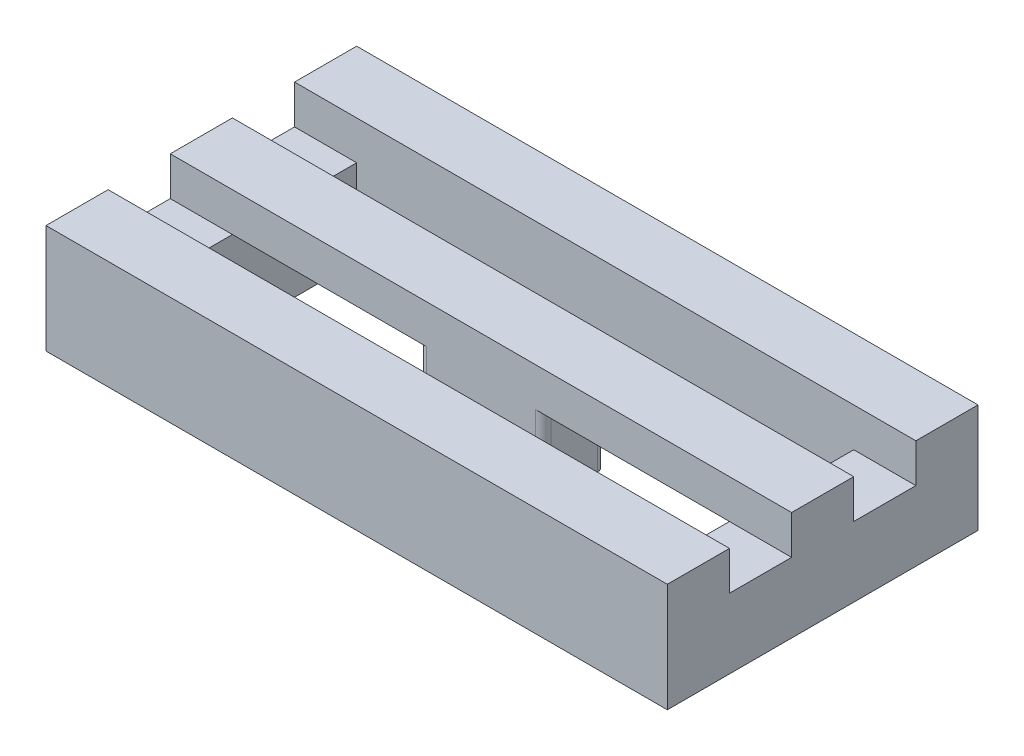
ISO-10303-21;
HEADER;
FILE_DESCRIPTION(('STEP AP214'),'2;1');
FILE_NAME('part.step','',(''),(''),'','','');
FILE_SCHEMA(('AUTOMOTIVE_DESIGN { 1 0 10303 214 1 1 1 1 }'));
ENDSEC;
DATA;
#1=APPLICATION_CONTEXT('core data for automotive mechanical design processes');
#2=APPLICATION_PROTOCOL_DEFINITION('international standard','automotive_design',2000,#1);
#3=PRODUCT_CONTEXT('',#1,'mechanical');
#4=PRODUCT('Part','Part','',(#3));
#5=PRODUCT_RELATED_PRODUCT_CATEGORY('part','',(#4));
#6=PRODUCT_DEFINITION_FORMATION('','',#4);
#7=PRODUCT_DEFINITION_CONTEXT('part definition',#1,'design');
#8=PRODUCT_DEFINITION('design','',#6,#7);
#9=PRODUCT_DEFINITION_SHAPE('','',#8);
#10=(LENGTH_UNIT() NAMED_UNIT(*) SI_UNIT(.MILLI.,.METRE.));
#11=(NAMED_UNIT(*) PLANE_ANGLE_UNIT() SI_UNIT($,.RADIAN.));
#12=(NAMED_UNIT(*) SI_UNIT($,.STERADIAN.) SOLID_ANGLE_UNIT());
#13=UNCERTAINTY_MEASURE_WITH_UNIT(LENGTH_MEASURE(1.E-05),#10,'distance_accuracy_value','');
#14=(GEOMETRIC_REPRESENTATION_CONTEXT(3) GLOBAL_UNCERTAINTY_ASSIGNED_CONTEXT((#13)) GLOBAL_UNIT_ASSIGNED_CONTEXT((#10,
#11,#12)) REPRESENTATION_CONTEXT('',''));
#15=CARTESIAN_POINT('',(0.,0.,0.));
#16=DIRECTION('',(0.,0.,1.));
#17=DIRECTION('',(1.,0.,0.));
#18=AXIS2_PLACEMENT_3D('',#15,#16,#17);
#19=CARTESIAN_POINT('',(0.,3.2,0.));
#20=DIRECTION('',(1.,0.,0.));
#21=DIRECTION('',(0.,0.,-1.));
#22=AXIS2_PLACEMENT_3D('',#19,#20,#21);
#23=PLANE('',#22);
#24=DIRECTION('',(0.,0.,1.));
#25=VECTOR('',#24,1.);
#26=CARTESIAN_POINT('',(0.,0.4,-18.0554430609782));
#27=LINE('',#26,#25);
#28=CARTESIAN_POINT('',(0.,0.4,-8.));
#29=VERTEX_POINT('',#28);
#30=CARTESIAN_POINT('',(0.,0.4,0.));
#31=VERTEX_POINT('',#30);
#32=EDGE_CURVE('E40',#29,#31,#27,.T.);
#33=ORIENTED_EDGE('',*,*,#32,.T.);
#34=DIRECTION('',(0.,-1.,0.));
#35=VECTOR('',#34,1.);
#36=CARTESIAN_POINT('',(0.,3.2,0.));
#37=LINE('',#36,#35);
#38=CARTESIAN_POINT('',(0.,3.2,0.));
#39=VERTEX_POINT('',#38);
#40=EDGE_CURVE('E403',#39,#31,#37,.T.);
#41=ORIENTED_EDGE('',*,*,#40,.F.);
#42=DIRECTION('',(0.,0.,1.));
#43=VECTOR('',#42,1.);
#44=CARTESIAN_POINT('',(0.,3.2,0.));
#45=LINE('',#44,#43);
#46=CARTESIAN_POINT('',(0.,3.2,-1.6));
#47=VERTEX_POINT('',#46);
#48=EDGE_CURVE('E373',#47,#39,#45,.T.);
#49=ORIENTED_EDGE('',*,*,#48,.F.);
#50=DIRECTION('',(0.,1.,0.));
#51=VECTOR('',#50,1.);
#52=CARTESIAN_POINT('',(0.,2.2,-1.6));
#53=LINE('',#52,#51);
#54=CARTESIAN_POINT('',(0.,2.2,-1.6));
#55=VERTEX_POINT('',#54);
#56=EDGE_CURVE('E346',#55,#47,#53,.T.);
#57=ORIENTED_EDGE('',*,*,#56,.F.);
#58=DIRECTION('',(0.,0.,1.));
#59=VECTOR('',#58,1.);
#60=CARTESIAN_POINT('',(0.,2.2,-4.));
#61=LINE('',#60,#59);
#62=CARTESIAN_POINT('',(0.,2.2,-3.2));
#63=VERTEX_POINT('',#62);
#64=EDGE_CURVE('E332',#63,#55,#61,.T.);
#65=ORIENTED_EDGE('',*,*,#64,.F.);
#66=DIRECTION('',(0.,1.,0.));
#67=VECTOR('',#66,1.);
#68=CARTESIAN_POINT('',(0.,2.2,-3.2));
#69=LINE('',#68,#67);
#70=CARTESIAN_POINT('',(0.,3.2,-3.2));
#71=VERTEX_POINT('',#70);
#72=EDGE_CURVE('E348',#63,#71,#69,.T.);
#73=ORIENTED_EDGE('',*,*,#72,.T.);
#74=CARTESIAN_POINT('',(0.,3.2,-4.8));
#75=VERTEX_POINT('',#74);
#76=EDGE_CURVE('E385',#75,#71,#45,.T.);
#77=ORIENTED_EDGE('',*,*,#76,.F.);
#78=DIRECTION('',(0.,1.,0.));
#79=VECTOR('',#78,1.);
#80=CARTESIAN_POINT('',(0.,2.2,-4.8));
#81=LINE('',#80,#79);
#82=CARTESIAN_POINT('',(0.,2.2,-4.8));
#83=VERTEX_POINT('',#82);
#84=EDGE_CURVE('E371',#83,#75,#81,.T.);
#85=ORIENTED_EDGE('',*,*,#84,.F.);
#86=DIRECTION('',(0.,0.,1.));
#87=VECTOR('',#86,1.);
#88=CARTESIAN_POINT('',(0.,2.2,-4.));
#89=LINE('',#88,#87);
#90=CARTESIAN_POINT('',(0.,2.2,-6.4));
#91=VERTEX_POINT('',#90);
#92=EDGE_CURVE('E367',#91,#83,#89,.T.);
#93=ORIENTED_EDGE('',*,*,#92,.F.);
#94=DIRECTION('',(0.,1.,0.));
#95=VECTOR('',#94,1.);
#96=CARTESIAN_POINT('',(0.,2.2,-6.4));
#97=LINE('',#96,#95);
#98=CARTESIAN_POINT('',(0.,3.2,-6.4));
#99=VERTEX_POINT('',#98);
#100=EDGE_CURVE('E374',#91,#99,#97,.T.);
#101=ORIENTED_EDGE('',*,*,#100,.T.);
#102=CARTESIAN_POINT('',(0.,3.2,-8.));
#103=VERTEX_POINT('',#102);
#104=EDGE_CURVE('E381',#103,#99,#45,.T.);
#105=ORIENTED_EDGE('',*,*,#104,.F.);
#106=DIRECTION('',(0.,-1.,0.));
#107=VECTOR('',#106,1.);
#108=CARTESIAN_POINT('',(0.,3.2,-8.));
#109=LINE('',#108,#107);
#110=EDGE_CURVE('E394',#103,#29,#109,.T.);
#111=ORIENTED_EDGE('',*,*,#110,.T.);
#112=EDGE_LOOP('',(#33,#41,#49,#57,#65,#73,#77,#85,#93,#101,#105,#111));
#113=FACE_BOUND('',#112,.T.);
#114=ADVANCED_FACE('F26',(#113),#23,.F.);
#115=CARTESIAN_POINT('',(16.,3.2,0.));
#116=DIRECTION('',(-1.,0.,0.));
#117=DIRECTION('',(0.,0.,1.));
#118=AXIS2_PLACEMENT_3D('',#115,#116,#117);
#119=PLANE('',#118);
#120=DIRECTION('',(0.,0.,-1.));
#121=VECTOR('',#120,1.);
#122=CARTESIAN_POINT('',(16.,0.4,-18.0554430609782));
#123=LINE('',#122,#121);
#124=CARTESIAN_POINT('',(16.,0.4,0.));
#125=VERTEX_POINT('',#124);
#126=CARTESIAN_POINT('',(16.,0.4,-8.));
#127=VERTEX_POINT('',#126);
#128=EDGE_CURVE('E251',#125,#127,#123,.T.);
#129=ORIENTED_EDGE('',*,*,#128,.T.);
#130=DIRECTION('',(0.,-1.,0.));
#131=VECTOR('',#130,1.);
#132=CARTESIAN_POINT('',(16.,3.2,-8.));
#133=LINE('',#132,#131);
#134=CARTESIAN_POINT('',(16.,3.2,-8.));
#135=VERTEX_POINT('',#134);
#136=EDGE_CURVE('E397',#135,#127,#133,.T.);
#137=ORIENTED_EDGE('',*,*,#136,.F.);
#138=DIRECTION('',(0.,0.,-1.));
#139=VECTOR('',#138,1.);
#140=CARTESIAN_POINT('',(16.,3.2,0.));
#141=LINE('',#140,#139);
#142=CARTESIAN_POINT('',(16.,3.2,-6.4));
#143=VERTEX_POINT('',#142);
#144=EDGE_CURVE('E387',#143,#135,#141,.T.);
#145=ORIENTED_EDGE('',*,*,#144,.F.);
#146=DIRECTION('',(0.,1.,0.));
#147=VECTOR('',#146,1.);
#148=CARTESIAN_POINT('',(16.,2.2,-6.4));
#149=LINE('',#148,#147);
#150=CARTESIAN_POINT('',(16.,2.2,-6.4));
#151=VERTEX_POINT('',#150);
#152=EDGE_CURVE('E377',#151,#143,#149,.T.);
#153=ORIENTED_EDGE('',*,*,#152,.F.);
#154=DIRECTION('',(0.,0.,-1.));
#155=VECTOR('',#154,1.);
#156=CARTESIAN_POINT('',(16.,2.2,-4.));
#157=LINE('',#156,#155);
#158=CARTESIAN_POINT('',(16.,2.2,-4.8));
#159=VERTEX_POINT('',#158);
#160=EDGE_CURVE('E360',#159,#151,#157,.T.);
#161=ORIENTED_EDGE('',*,*,#160,.F.);
#162=DIRECTION('',(0.,1.,0.));
#163=VECTOR('',#162,1.);
#164=CARTESIAN_POINT('',(16.,2.2,-4.8));
#165=LINE('',#164,#163);
#166=CARTESIAN_POINT('',(16.,3.2,-4.8));
#167=VERTEX_POINT('',#166);
#168=EDGE_CURVE('E370',#159,#167,#165,.T.);
#169=ORIENTED_EDGE('',*,*,#168,.T.);
#170=CARTESIAN_POINT('',(16.,3.2,-3.2));
#171=VERTEX_POINT('',#170);
#172=EDGE_CURVE('E392',#171,#167,#141,.T.);
#173=ORIENTED_EDGE('',*,*,#172,.F.);
#174=DIRECTION('',(0.,1.,0.));
#175=VECTOR('',#174,1.);
#176=CARTESIAN_POINT('',(16.,2.2,-3.2));
#177=LINE('',#176,#175);
#178=CARTESIAN_POINT('',(16.,2.2,-3.2));
#179=VERTEX_POINT('',#178);
#180=EDGE_CURVE('E341',#179,#171,#177,.T.);
#181=ORIENTED_EDGE('',*,*,#180,.F.);
#182=DIRECTION('',(0.,0.,-1.));
#183=VECTOR('',#182,1.);
#184=CARTESIAN_POINT('',(16.,2.2,-4.));
#185=LINE('',#184,#183);
#186=CARTESIAN_POINT('',(16.,2.2,-1.6));
#187=VERTEX_POINT('',#186);
#188=EDGE_CURVE('E325',#187,#179,#185,.T.);
#189=ORIENTED_EDGE('',*,*,#188,.F.);
#190=DIRECTION('',(0.,1.,0.));
#191=VECTOR('',#190,1.);
#192=CARTESIAN_POINT('',(16.,2.2,-1.6));
#193=LINE('',#192,#191);
#194=CARTESIAN_POINT('',(16.,3.2,-1.6));
#195=VERTEX_POINT('',#194);
#196=EDGE_CURVE('E342',#187,#195,#193,.T.);
#197=ORIENTED_EDGE('',*,*,#196,.T.);
#198=CARTESIAN_POINT('',(16.,3.2,0.));
#199=VERTEX_POINT('',#198);
#200=EDGE_CURVE('E388',#199,#195,#141,.T.);
#201=ORIENTED_EDGE('',*,*,#200,.F.);
#202=DIRECTION('',(0.,-1.,0.));
#203=VECTOR('',#202,1.);
#204=CARTESIAN_POINT('',(16.,3.2,0.));
#205=LINE('',#204,#203);
#206=EDGE_CURVE('E400',#199,#125,#205,.T.);
#207=ORIENTED_EDGE('',*,*,#206,.T.);
#208=EDGE_LOOP('',(#129,#137,#145,#153,#161,#169,#173,#181,#189,#197,#201,#207));
#209=FACE_BOUND('',#208,.T.);
#210=ADVANCED_FACE('F498',(#209),#119,.F.);
#211=CARTESIAN_POINT('',(0.,3.2,0.));
#212=DIRECTION('',(0.,0.,-1.));
#213=DIRECTION('',(-1.,0.,0.));
#214=AXIS2_PLACEMENT_3D('',#211,#212,#213);
#215=PLANE('',#214);
#216=DIRECTION('',(1.,0.,0.));
#217=VECTOR('',#216,1.);
#218=CARTESIAN_POINT('',(8.,0.4,0.));
#219=LINE('',#218,#217);
#220=EDGE_CURVE('E254',#31,#125,#219,.T.);
#221=ORIENTED_EDGE('',*,*,#220,.T.);
#222=ORIENTED_EDGE('',*,*,#206,.F.);
#223=DIRECTION('',(1.,0.,0.));
#224=VECTOR('',#223,1.);
#225=CARTESIAN_POINT('',(0.,3.2,0.));
#226=LINE('',#225,#224);
#227=EDGE_CURVE('E384',#39,#199,#226,.T.);
#228=ORIENTED_EDGE('',*,*,#227,.F.);
#229=ORIENTED_EDGE('',*,*,#40,.T.);
#230=EDGE_LOOP('',(#221,#222,#228,#229));
#231=FACE_BOUND('',#230,.T.);
#232=ADVANCED_FACE('F530',(#231),#215,.F.);
#233=CARTESIAN_POINT('',(0.,3.2,-8.));
#234=DIRECTION('',(0.,0.,1.));
#235=DIRECTION('',(1.,0.,0.));
#236=AXIS2_PLACEMENT_3D('',#233,#234,#235);
#237=PLANE('',#236);
#238=DIRECTION('',(-1.,0.,0.));
#239=VECTOR('',#238,1.);
#240=CARTESIAN_POINT('',(8.,0.4,-8.));
#241=LINE('',#240,#239);
#242=EDGE_CURVE('E249',#127,#29,#241,.T.);
#243=ORIENTED_EDGE('',*,*,#242,.T.);
#244=ORIENTED_EDGE('',*,*,#110,.F.);
#245=DIRECTION('',(-1.,0.,0.));
#246=VECTOR('',#245,1.);
#247=CARTESIAN_POINT('',(0.,3.2,-8.));
#248=LINE('',#247,#246);
#249=EDGE_CURVE('E391',#135,#103,#248,.T.);
#250=ORIENTED_EDGE('',*,*,#249,.F.);
#251=ORIENTED_EDGE('',*,*,#136,.T.);
#252=EDGE_LOOP('',(#243,#244,#250,#251));
#253=FACE_BOUND('',#252,.T.);
#254=ADVANCED_FACE('F500',(#253),#237,.F.);
#255=CARTESIAN_POINT('',(1.6,2.2,-6.4));
#256=DIRECTION('',(0.,-1.,0.));
#257=DIRECTION('',(0.,0.,-1.));
#258=AXIS2_PLACEMENT_3D('',#255,#256,#257);
#259=PLANE('',#258);
#260=DIRECTION('',(-1.,0.,0.));
#261=VECTOR('',#260,1.);
#262=CARTESIAN_POINT('',(-6.05544306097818,2.2,-4.8));
#263=LINE('',#262,#261);
#264=CARTESIAN_POINT('',(6.6,2.2,-4.8));
#265=VERTEX_POINT('',#264);
#266=CARTESIAN_POINT('',(1.6,2.2,-4.8));
#267=VERTEX_POINT('',#266);
#268=EDGE_CURVE('E311',#265,#267,#263,.T.);
#269=ORIENTED_EDGE('',*,*,#268,.F.);
#270=CARTESIAN_POINT('',(6.6,2.2,-4.6));
#271=DIRECTION('',(0.,-1.,0.));
#272=DIRECTION('',(0.,0.,-1.));
#273=AXIS2_PLACEMENT_3D('',#270,#271,#272);
#274=CIRCLE('',#273,0.2);
#275=CARTESIAN_POINT('',(6.4,2.2,-4.6));
#276=VERTEX_POINT('',#275);
#277=EDGE_CURVE('E436',#265,#276,#274,.F.);
#278=ORIENTED_EDGE('',*,*,#277,.T.);
#279=DIRECTION('',(0.,0.,-1.));
#280=VECTOR('',#279,1.);
#281=CARTESIAN_POINT('',(6.4,2.2,-3.2));
#282=LINE('',#281,#280);
#283=CARTESIAN_POINT('',(6.4,2.2,-3.4));
#284=VERTEX_POINT('',#283);
#285=EDGE_CURVE('E268',#284,#276,#282,.T.);
#286=ORIENTED_EDGE('',*,*,#285,.F.);
#287=CARTESIAN_POINT('',(6.6,2.2,-3.4));
#288=DIRECTION('',(0.,-1.,0.));
#289=DIRECTION('',(0.,0.,-1.));
#290=AXIS2_PLACEMENT_3D('',#287,#288,#289);
#291=CIRCLE('',#290,0.2);
#292=CARTESIAN_POINT('',(6.6,2.2,-3.2));
#293=VERTEX_POINT('',#292);
#294=EDGE_CURVE('E438',#284,#293,#291,.F.);
#295=ORIENTED_EDGE('',*,*,#294,.T.);
#296=DIRECTION('',(-1.,0.,0.));
#297=VECTOR('',#296,1.);
#298=CARTESIAN_POINT('',(-6.05544306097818,2.2,-3.2));
#299=LINE('',#298,#297);
#300=CARTESIAN_POINT('',(1.6,2.2,-3.2));
#301=VERTEX_POINT('',#300);
#302=EDGE_CURVE('E334',#293,#301,#299,.T.);
#303=ORIENTED_EDGE('',*,*,#302,.T.);
#304=DIRECTION('',(0.,0.,-1.));
#305=VECTOR('',#304,1.);
#306=CARTESIAN_POINT('',(1.6,2.2,-1.6));
#307=LINE('',#306,#305);
#308=EDGE_CURVE('E304',#301,#267,#307,.T.);
#309=ORIENTED_EDGE('',*,*,#308,.T.);
#310=EDGE_LOOP('',(#269,#278,#286,#295,#303,#309));
#311=FACE_BOUND('',#310,.T.);
#312=ADVANCED_FACE('F475',(#311),#259,.T.);
#313=CARTESIAN_POINT('',(14.4,2.2,-3.2));
#314=VERTEX_POINT('',#313);
#315=CARTESIAN_POINT('',(9.4,2.2,-3.2));
#316=VERTEX_POINT('',#315);
#317=EDGE_CURVE('E333',#314,#316,#299,.T.);
#318=ORIENTED_EDGE('',*,*,#317,.T.);
#319=CARTESIAN_POINT('',(9.4,2.2,-3.4));
#320=DIRECTION('',(0.,-1.,0.));
#321=DIRECTION('',(0.,0.,-1.));
#322=AXIS2_PLACEMENT_3D('',#319,#320,#321);
#323=CIRCLE('',#322,0.2);
#324=CARTESIAN_POINT('',(9.6,2.2,-3.4));
#325=VERTEX_POINT('',#324);
#326=EDGE_CURVE('E11',#316,#325,#323,.F.);
#327=ORIENTED_EDGE('',*,*,#326,.T.);
#328=DIRECTION('',(0.,0.,1.));
#329=VECTOR('',#328,1.);
#330=CARTESIAN_POINT('',(9.6,2.2,-3.2));
#331=LINE('',#330,#329);
#332=CARTESIAN_POINT('',(9.6,2.2,-4.6));
#333=VERTEX_POINT('',#332);
#334=EDGE_CURVE('E273',#333,#325,#331,.T.);
#335=ORIENTED_EDGE('',*,*,#334,.F.);
#336=CARTESIAN_POINT('',(9.4,2.2,-4.6));
#337=DIRECTION('',(0.,-1.,0.));
#338=DIRECTION('',(0.,0.,-1.));
#339=AXIS2_PLACEMENT_3D('',#336,#337,#338);
#340=CIRCLE('',#339,0.2);
#341=CARTESIAN_POINT('',(9.4,2.2,-4.8));
#342=VERTEX_POINT('',#341);
#343=EDGE_CURVE('E33',#333,#342,#340,.F.);
#344=ORIENTED_EDGE('',*,*,#343,.T.);
#345=CARTESIAN_POINT('',(14.4,2.2,-4.8));
#346=VERTEX_POINT('',#345);
#347=EDGE_CURVE('E318',#346,#342,#263,.T.);
#348=ORIENTED_EDGE('',*,*,#347,.F.);
#349=DIRECTION('',(0.,0.,1.));
#350=VECTOR('',#349,1.);
#351=CARTESIAN_POINT('',(14.4,2.2,-1.6));
#352=LINE('',#351,#350);
#353=EDGE_CURVE('E303',#346,#314,#352,.T.);
#354=ORIENTED_EDGE('',*,*,#353,.T.);
#355=EDGE_LOOP('',(#318,#327,#335,#344,#348,#354));
#356=FACE_BOUND('',#355,.T.);
#357=ADVANCED_FACE('F444',(#356),#259,.T.);
#358=CARTESIAN_POINT('',(-6.05544306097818,2.2,-4.));
#359=DIRECTION('',(0.,1.,0.));
#360=DIRECTION('',(0.,0.,1.));
#361=AXIS2_PLACEMENT_3D('',#358,#359,#360);
#362=PLANE('',#361);
#363=CARTESIAN_POINT('',(1.6,2.2,-6.4));
#364=VERTEX_POINT('',#363);
#365=EDGE_CURVE('E299',#267,#364,#307,.T.);
#366=ORIENTED_EDGE('',*,*,#365,.T.);
#367=DIRECTION('',(-1.,0.,0.));
#368=VECTOR('',#367,1.);
#369=CARTESIAN_POINT('',(-6.05544306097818,2.2,-6.4));
#370=LINE('',#369,#368);
#371=EDGE_CURVE('E363',#364,#91,#370,.T.);
#372=ORIENTED_EDGE('',*,*,#371,.T.);
#373=ORIENTED_EDGE('',*,*,#92,.T.);
#374=DIRECTION('',(-1.,0.,0.));
#375=VECTOR('',#374,1.);
#376=CARTESIAN_POINT('',(-6.05544306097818,2.2,-4.8));
#377=LINE('',#376,#375);
#378=EDGE_CURVE('E356',#267,#83,#377,.T.);
#379=ORIENTED_EDGE('',*,*,#378,.F.);
#380=EDGE_LOOP('',(#366,#372,#373,#379));
#381=FACE_BOUND('',#380,.T.);
#382=ADVANCED_FACE('F476',(#381),#362,.T.);
#383=CARTESIAN_POINT('',(-6.05544306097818,2.2,-4.));
#384=DIRECTION('',(0.,1.,0.));
#385=DIRECTION('',(0.,0.,1.));
#386=AXIS2_PLACEMENT_3D('',#383,#384,#385);
#387=PLANE('',#386);
#388=CARTESIAN_POINT('',(1.6,2.2,-1.6));
#389=VERTEX_POINT('',#388);
#390=EDGE_CURVE('E300',#389,#301,#307,.T.);
#391=ORIENTED_EDGE('',*,*,#390,.T.);
#392=EDGE_CURVE('E328',#301,#63,#299,.T.);
#393=ORIENTED_EDGE('',*,*,#392,.T.);
#394=ORIENTED_EDGE('',*,*,#64,.T.);
#395=DIRECTION('',(-1.,0.,0.));
#396=VECTOR('',#395,1.);
#397=CARTESIAN_POINT('',(-6.05544306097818,2.2,-1.6));
#398=LINE('',#397,#396);
#399=EDGE_CURVE('E337',#389,#55,#398,.T.);
#400=ORIENTED_EDGE('',*,*,#399,.F.);
#401=EDGE_LOOP('',(#391,#393,#394,#400));
#402=FACE_BOUND('',#401,.T.);
#403=ADVANCED_FACE('F537',(#402),#387,.T.);
#404=CARTESIAN_POINT('',(0.,3.2,-8.));
#405=DIRECTION('',(0.,-1.,0.));
#406=DIRECTION('',(0.,0.,-1.));
#407=AXIS2_PLACEMENT_3D('',#404,#405,#406);
#408=PLANE('',#407);
#409=DIRECTION('',(-1.,0.,0.));
#410=VECTOR('',#409,1.);
#411=CARTESIAN_POINT('',(-6.05544306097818,3.2,-1.6));
#412=LINE('',#411,#410);
#413=EDGE_CURVE('E322',#195,#47,#412,.T.);
#414=ORIENTED_EDGE('',*,*,#413,.T.);
#415=ORIENTED_EDGE('',*,*,#48,.T.);
#416=ORIENTED_EDGE('',*,*,#227,.T.);
#417=ORIENTED_EDGE('',*,*,#200,.T.);
#418=EDGE_LOOP('',(#414,#415,#416,#417));
#419=FACE_BOUND('',#418,.T.);
#420=ADVANCED_FACE('F524',(#419),#408,.F.);
#421=ORIENTED_EDGE('',*,*,#76,.T.);
#422=DIRECTION('',(-1.,0.,0.));
#423=VECTOR('',#422,1.);
#424=CARTESIAN_POINT('',(-6.05544306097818,3.2,-3.2));
#425=LINE('',#424,#423);
#426=EDGE_CURVE('E320',#171,#71,#425,.T.);
#427=ORIENTED_EDGE('',*,*,#426,.F.);
#428=ORIENTED_EDGE('',*,*,#172,.T.);
#429=DIRECTION('',(-1.,0.,0.));
#430=VECTOR('',#429,1.);
#431=CARTESIAN_POINT('',(-6.05544306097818,3.2,-4.8));
#432=LINE('',#431,#430);
#433=EDGE_CURVE('E345',#167,#75,#432,.T.);
#434=ORIENTED_EDGE('',*,*,#433,.T.);
#435=EDGE_LOOP('',(#421,#427,#428,#434));
#436=FACE_BOUND('',#435,.T.);
#437=ADVANCED_FACE('F485',(#436),#408,.F.);
#438=ORIENTED_EDGE('',*,*,#104,.T.);
#439=DIRECTION('',(-1.,0.,0.));
#440=VECTOR('',#439,1.);
#441=CARTESIAN_POINT('',(-6.05544306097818,3.2,-6.4));
#442=LINE('',#441,#440);
#443=EDGE_CURVE('E354',#143,#99,#442,.T.);
#444=ORIENTED_EDGE('',*,*,#443,.F.);
#445=ORIENTED_EDGE('',*,*,#144,.T.);
#446=ORIENTED_EDGE('',*,*,#249,.T.);
#447=EDGE_LOOP('',(#438,#444,#445,#446));
#448=FACE_BOUND('',#447,.T.);
#449=ADVANCED_FACE('F494',(#448),#408,.F.);
#450=CARTESIAN_POINT('',(0.,0.,-8.));
#451=DIRECTION('',(0.,-1.,0.));
#452=DIRECTION('',(0.,0.,-1.));
#453=AXIS2_PLACEMENT_3D('',#450,#451,#452);
#454=PLANE('',#453);
#455=DIRECTION('',(1.,0.,0.));
#456=VECTOR('',#455,1.);
#457=CARTESIAN_POINT('',(8.,0.,-0.400000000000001));
#458=LINE('',#457,#456);
#459=CARTESIAN_POINT('',(0.4,0.,-0.400000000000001));
#460=VERTEX_POINT('',#459);
#461=CARTESIAN_POINT('',(15.6,0.,-0.400000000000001));
#462=VERTEX_POINT('',#461);
#463=EDGE_CURVE('E48',#460,#462,#458,.T.);
#464=ORIENTED_EDGE('',*,*,#463,.F.);
#465=DIRECTION('',(0.,0.,-1.));
#466=VECTOR('',#465,1.);
#467=CARTESIAN_POINT('',(0.400000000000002,0.,-18.0554430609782));
#468=LINE('',#467,#466);
#469=CARTESIAN_POINT('',(0.400000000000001,0.,-7.6));
#470=VERTEX_POINT('',#469);
#471=EDGE_CURVE('E243',#460,#470,#468,.T.);
#472=ORIENTED_EDGE('',*,*,#471,.T.);
#473=DIRECTION('',(1.,0.,0.));
#474=VECTOR('',#473,1.);
#475=CARTESIAN_POINT('',(8.,0.,-7.6));
#476=LINE('',#475,#474);
#477=CARTESIAN_POINT('',(15.6,0.,-7.6));
#478=VERTEX_POINT('',#477);
#479=EDGE_CURVE('E225',#470,#478,#476,.T.);
#480=ORIENTED_EDGE('',*,*,#479,.T.);
#481=DIRECTION('',(0.,0.,-1.));
#482=VECTOR('',#481,1.);
#483=CARTESIAN_POINT('',(15.6,0.,-18.0554430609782));
#484=LINE('',#483,#482);
#485=EDGE_CURVE('E235',#462,#478,#484,.T.);
#486=ORIENTED_EDGE('',*,*,#485,.F.);
#487=EDGE_LOOP('',(#464,#472,#480,#486));
#488=FACE_BOUND('',#487,.T.);
#489=DIRECTION('',(0.,0.,-1.));
#490=VECTOR('',#489,1.);
#491=CARTESIAN_POINT('',(1.6,0.,-1.6));
#492=LINE('',#491,#490);
#493=CARTESIAN_POINT('',(1.6,0.,-1.6));
#494=VERTEX_POINT('',#493);
#495=CARTESIAN_POINT('',(1.6,0.,-6.4));
#496=VERTEX_POINT('',#495);
#497=EDGE_CURVE('E288',#494,#496,#492,.T.);
#498=ORIENTED_EDGE('',*,*,#497,.F.);
#499=DIRECTION('',(-1.,0.,0.));
#500=VECTOR('',#499,1.);
#501=CARTESIAN_POINT('',(1.6,0.,-1.6));
#502=LINE('',#501,#500);
#503=CARTESIAN_POINT('',(14.4,0.,-1.6));
#504=VERTEX_POINT('',#503);
#505=EDGE_CURVE('E296',#504,#494,#502,.T.);
#506=ORIENTED_EDGE('',*,*,#505,.F.);
#507=DIRECTION('',(0.,0.,1.));
#508=VECTOR('',#507,1.);
#509=CARTESIAN_POINT('',(14.4,0.,-1.6));
#510=LINE('',#509,#508);
#511=CARTESIAN_POINT('',(14.4,0.,-6.4));
#512=VERTEX_POINT('',#511);
#513=EDGE_CURVE('E293',#512,#504,#510,.T.);
#514=ORIENTED_EDGE('',*,*,#513,.F.);
#515=DIRECTION('',(1.,0.,0.));
#516=VECTOR('',#515,1.);
#517=CARTESIAN_POINT('',(1.6,0.,-6.4));
#518=LINE('',#517,#516);
#519=EDGE_CURVE('E290',#496,#512,#518,.T.);
#520=ORIENTED_EDGE('',*,*,#519,.F.);
#521=EDGE_LOOP('',(#498,#506,#514,#520));
#522=FACE_BOUND('',#521,.T.);
#523=ADVANCED_FACE('F240',(#488,#522),#454,.T.);
#524=CARTESIAN_POINT('',(-6.05544306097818,2.2,-4.8));
#525=DIRECTION('',(0.,0.,-1.));
#526=DIRECTION('',(-1.,0.,0.));
#527=AXIS2_PLACEMENT_3D('',#524,#525,#526);
#528=PLANE('',#527);
#529=DIRECTION('',(1.,0.,0.));
#530=VECTOR('',#529,1.);
#531=CARTESIAN_POINT('',(6.4,0.2,-4.8));
#532=LINE('',#531,#530);
#533=CARTESIAN_POINT('',(6.6,0.2,-4.8));
#534=VERTEX_POINT('',#533);
#535=CARTESIAN_POINT('',(9.4,0.2,-4.8));
#536=VERTEX_POINT('',#535);
#537=EDGE_CURVE('E279',#534,#536,#532,.T.);
#538=ORIENTED_EDGE('',*,*,#537,.F.);
#539=DIRECTION('',(0.,1.,0.));
#540=VECTOR('',#539,1.);
#541=CARTESIAN_POINT('',(6.6,2.2,-4.8));
#542=LINE('',#541,#540);
#543=EDGE_CURVE('E410',#534,#265,#542,.T.);
#544=ORIENTED_EDGE('',*,*,#543,.T.);
#545=ORIENTED_EDGE('',*,*,#268,.T.);
#546=ORIENTED_EDGE('',*,*,#378,.T.);
#547=ORIENTED_EDGE('',*,*,#84,.T.);
#548=ORIENTED_EDGE('',*,*,#433,.F.);
#549=ORIENTED_EDGE('',*,*,#168,.F.);
#550=EDGE_CURVE('E357',#159,#346,#377,.T.);
#551=ORIENTED_EDGE('',*,*,#550,.T.);
#552=ORIENTED_EDGE('',*,*,#347,.T.);
#553=DIRECTION('',(0.,1.,0.));
#554=VECTOR('',#553,1.);
#555=CARTESIAN_POINT('',(9.4,0.2,-4.8));
#556=LINE('',#555,#554);
#557=EDGE_CURVE('E408',#342,#536,#556,.F.);
#558=ORIENTED_EDGE('',*,*,#557,.T.);
#559=EDGE_LOOP('',(#538,#544,#545,#546,#547,#548,#549,#551,#552,#558));
#560=FACE_BOUND('',#559,.T.);
#561=ADVANCED_FACE('F453',(#560),#528,.T.);
#562=CARTESIAN_POINT('',(-6.05544306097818,2.2,-6.4));
#563=DIRECTION('',(0.,0.,-1.));
#564=DIRECTION('',(-1.,0.,0.));
#565=AXIS2_PLACEMENT_3D('',#562,#563,#564);
#566=PLANE('',#565);
#567=ORIENTED_EDGE('',*,*,#443,.T.);
#568=ORIENTED_EDGE('',*,*,#100,.F.);
#569=ORIENTED_EDGE('',*,*,#371,.F.);
#570=DIRECTION('',(0.,-1.,0.));
#571=VECTOR('',#570,1.);
#572=CARTESIAN_POINT('',(1.6,2.2,-6.4));
#573=LINE('',#572,#571);
#574=EDGE_CURVE('E308',#364,#496,#573,.T.);
#575=ORIENTED_EDGE('',*,*,#574,.T.);
#576=ORIENTED_EDGE('',*,*,#519,.T.);
#577=DIRECTION('',(0.,-1.,0.));
#578=VECTOR('',#577,1.);
#579=CARTESIAN_POINT('',(14.4,2.2,-6.4));
#580=LINE('',#579,#578);
#581=CARTESIAN_POINT('',(14.4,2.2,-6.4));
#582=VERTEX_POINT('',#581);
#583=EDGE_CURVE('E314',#582,#512,#580,.T.);
#584=ORIENTED_EDGE('',*,*,#583,.F.);
#585=EDGE_CURVE('E364',#151,#582,#370,.T.);
#586=ORIENTED_EDGE('',*,*,#585,.F.);
#587=ORIENTED_EDGE('',*,*,#152,.T.);
#588=EDGE_LOOP('',(#567,#568,#569,#575,#576,#584,#586,#587));
#589=FACE_BOUND('',#588,.T.);
#590=ADVANCED_FACE('F503',(#589),#566,.F.);
#591=EDGE_CURVE('E305',#582,#346,#352,.T.);
#592=ORIENTED_EDGE('',*,*,#591,.T.);
#593=ORIENTED_EDGE('',*,*,#550,.F.);
#594=ORIENTED_EDGE('',*,*,#160,.T.);
#595=ORIENTED_EDGE('',*,*,#585,.T.);
#596=EDGE_LOOP('',(#592,#593,#594,#595));
#597=FACE_BOUND('',#596,.T.);
#598=ADVANCED_FACE('F508',(#597),#362,.T.);
#599=CARTESIAN_POINT('',(-6.05544306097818,2.2,-1.6));
#600=DIRECTION('',(0.,0.,-1.));
#601=DIRECTION('',(-1.,0.,0.));
#602=AXIS2_PLACEMENT_3D('',#599,#600,#601);
#603=PLANE('',#602);
#604=ORIENTED_EDGE('',*,*,#413,.F.);
#605=ORIENTED_EDGE('',*,*,#196,.F.);
#606=CARTESIAN_POINT('',(14.4,2.2,-1.6));
#607=VERTEX_POINT('',#606);
#608=EDGE_CURVE('E338',#187,#607,#398,.T.);
#609=ORIENTED_EDGE('',*,*,#608,.T.);
#610=DIRECTION('',(0.,-1.,0.));
#611=VECTOR('',#610,1.);
#612=CARTESIAN_POINT('',(14.4,2.2,-1.6));
#613=LINE('',#612,#611);
#614=EDGE_CURVE('E312',#607,#504,#613,.T.);
#615=ORIENTED_EDGE('',*,*,#614,.T.);
#616=ORIENTED_EDGE('',*,*,#505,.T.);
#617=DIRECTION('',(0.,-1.,0.));
#618=VECTOR('',#617,1.);
#619=CARTESIAN_POINT('',(1.6,2.2,-1.6));
#620=LINE('',#619,#618);
#621=EDGE_CURVE('E309',#389,#494,#620,.T.);
#622=ORIENTED_EDGE('',*,*,#621,.F.);
#623=ORIENTED_EDGE('',*,*,#399,.T.);
#624=ORIENTED_EDGE('',*,*,#56,.T.);
#625=EDGE_LOOP('',(#604,#605,#609,#615,#616,#622,#623,#624));
#626=FACE_BOUND('',#625,.T.);
#627=ADVANCED_FACE('F521',(#626),#603,.T.);
#628=CARTESIAN_POINT('',(-6.05544306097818,2.2,-3.2));
#629=DIRECTION('',(0.,0.,-1.));
#630=DIRECTION('',(-1.,0.,0.));
#631=AXIS2_PLACEMENT_3D('',#628,#629,#630);
#632=PLANE('',#631);
#633=ORIENTED_EDGE('',*,*,#302,.F.);
#634=DIRECTION('',(0.,1.,0.));
#635=VECTOR('',#634,1.);
#636=CARTESIAN_POINT('',(6.6,2.2,-3.2));
#637=LINE('',#636,#635);
#638=CARTESIAN_POINT('',(6.6,0.2,-3.2));
#639=VERTEX_POINT('',#638);
#640=EDGE_CURVE('E429',#293,#639,#637,.F.);
#641=ORIENTED_EDGE('',*,*,#640,.T.);
#642=DIRECTION('',(-1.,0.,0.));
#643=VECTOR('',#642,1.);
#644=CARTESIAN_POINT('',(6.4,0.2,-3.2));
#645=LINE('',#644,#643);
#646=CARTESIAN_POINT('',(9.4,0.2,-3.2));
#647=VERTEX_POINT('',#646);
#648=EDGE_CURVE('E285',#647,#639,#645,.T.);
#649=ORIENTED_EDGE('',*,*,#648,.F.);
#650=DIRECTION('',(0.,1.,0.));
#651=VECTOR('',#650,1.);
#652=CARTESIAN_POINT('',(9.4,2.2,-3.2));
#653=LINE('',#652,#651);
#654=EDGE_CURVE('E426',#647,#316,#653,.T.);
#655=ORIENTED_EDGE('',*,*,#654,.T.);
#656=ORIENTED_EDGE('',*,*,#317,.F.);
#657=EDGE_CURVE('E329',#179,#314,#299,.T.);
#658=ORIENTED_EDGE('',*,*,#657,.F.);
#659=ORIENTED_EDGE('',*,*,#180,.T.);
#660=ORIENTED_EDGE('',*,*,#426,.T.);
#661=ORIENTED_EDGE('',*,*,#72,.F.);
#662=ORIENTED_EDGE('',*,*,#392,.F.);
#663=EDGE_LOOP('',(#633,#641,#649,#655,#656,#658,#659,#660,#661,#662));
#664=FACE_BOUND('',#663,.T.);
#665=ADVANCED_FACE('F541',(#664),#632,.F.);
#666=DIRECTION('',(0.,0.,-1.));
#667=VECTOR('',#666,1.);
#668=CARTESIAN_POINT('',(14.4,2.2,-4.));
#669=LINE('',#668,#667);
#670=EDGE_CURVE('E406',#607,#314,#669,.T.);
#671=ORIENTED_EDGE('',*,*,#670,.F.);
#672=ORIENTED_EDGE('',*,*,#608,.F.);
#673=ORIENTED_EDGE('',*,*,#188,.T.);
#674=ORIENTED_EDGE('',*,*,#657,.T.);
#675=EDGE_LOOP('',(#671,#672,#673,#674));
#676=FACE_BOUND('',#675,.T.);
#677=ADVANCED_FACE('F519',(#676),#387,.T.);
#678=CARTESIAN_POINT('',(1.6,2.2,-1.6));
#679=DIRECTION('',(-1.,0.,0.));
#680=DIRECTION('',(0.,0.,1.));
#681=AXIS2_PLACEMENT_3D('',#678,#679,#680);
#682=PLANE('',#681);
#683=ORIENTED_EDGE('',*,*,#497,.T.);
#684=ORIENTED_EDGE('',*,*,#574,.F.);
#685=ORIENTED_EDGE('',*,*,#365,.F.);
#686=ORIENTED_EDGE('',*,*,#308,.F.);
#687=ORIENTED_EDGE('',*,*,#390,.F.);
#688=ORIENTED_EDGE('',*,*,#621,.T.);
#689=EDGE_LOOP('',(#683,#684,#685,#686,#687,#688));
#690=FACE_BOUND('',#689,.T.);
#691=ADVANCED_FACE('F471',(#690),#682,.F.);
#692=CARTESIAN_POINT('',(14.4,2.2,-1.6));
#693=DIRECTION('',(1.,0.,0.));
#694=DIRECTION('',(0.,0.,-1.));
#695=AXIS2_PLACEMENT_3D('',#692,#693,#694);
#696=PLANE('',#695);
#697=ORIENTED_EDGE('',*,*,#513,.T.);
#698=ORIENTED_EDGE('',*,*,#614,.F.);
#699=ORIENTED_EDGE('',*,*,#670,.T.);
#700=ORIENTED_EDGE('',*,*,#353,.F.);
#701=ORIENTED_EDGE('',*,*,#591,.F.);
#702=ORIENTED_EDGE('',*,*,#583,.T.);
#703=EDGE_LOOP('',(#697,#698,#699,#700,#701,#702));
#704=FACE_BOUND('',#703,.T.);
#705=ADVANCED_FACE('F510',(#704),#696,.F.);
#706=CARTESIAN_POINT('',(6.4,0.2,-3.2));
#707=DIRECTION('',(1.,0.,0.));
#708=DIRECTION('',(0.,0.,-1.));
#709=AXIS2_PLACEMENT_3D('',#706,#707,#708);
#710=PLANE('',#709);
#711=ORIENTED_EDGE('',*,*,#285,.T.);
#712=DIRECTION('',(0.,1.,0.));
#713=VECTOR('',#712,1.);
#714=CARTESIAN_POINT('',(6.4,0.2,-4.6));
#715=LINE('',#714,#713);
#716=CARTESIAN_POINT('',(6.4,0.2,-4.6));
#717=VERTEX_POINT('',#716);
#718=EDGE_CURVE('E416',#276,#717,#715,.F.);
#719=ORIENTED_EDGE('',*,*,#718,.T.);
#720=DIRECTION('',(0.,0.,-1.));
#721=VECTOR('',#720,1.);
#722=CARTESIAN_POINT('',(6.4,0.2,-3.2));
#723=LINE('',#722,#721);
#724=CARTESIAN_POINT('',(6.4,0.2,-3.4));
#725=VERTEX_POINT('',#724);
#726=EDGE_CURVE('E276',#725,#717,#723,.T.);
#727=ORIENTED_EDGE('',*,*,#726,.F.);
#728=DIRECTION('',(0.,1.,0.));
#729=VECTOR('',#728,1.);
#730=CARTESIAN_POINT('',(6.4,0.2,-3.4));
#731=LINE('',#730,#729);
#732=EDGE_CURVE('E413',#725,#284,#731,.T.);
#733=ORIENTED_EDGE('',*,*,#732,.T.);
#734=EDGE_LOOP('',(#711,#719,#727,#733));
#735=FACE_BOUND('',#734,.T.);
#736=ADVANCED_FACE('F558',(#735),#710,.F.);
#737=CARTESIAN_POINT('',(9.6,0.2,-3.2));
#738=DIRECTION('',(-1.,0.,0.));
#739=DIRECTION('',(0.,0.,1.));
#740=AXIS2_PLACEMENT_3D('',#737,#738,#739);
#741=PLANE('',#740);
#742=DIRECTION('',(0.,0.,1.));
#743=VECTOR('',#742,1.);
#744=CARTESIAN_POINT('',(9.6,0.2,-3.2));
#745=LINE('',#744,#743);
#746=CARTESIAN_POINT('',(9.6,0.2,-4.6));
#747=VERTEX_POINT('',#746);
#748=CARTESIAN_POINT('',(9.6,0.2,-3.4));
#749=VERTEX_POINT('',#748);
#750=EDGE_CURVE('E282',#747,#749,#745,.T.);
#751=ORIENTED_EDGE('',*,*,#750,.F.);
#752=DIRECTION('',(0.,1.,0.));
#753=VECTOR('',#752,1.);
#754=CARTESIAN_POINT('',(9.6,2.2,-4.6));
#755=LINE('',#754,#753);
#756=EDGE_CURVE('E433',#747,#333,#755,.T.);
#757=ORIENTED_EDGE('',*,*,#756,.T.);
#758=ORIENTED_EDGE('',*,*,#334,.T.);
#759=DIRECTION('',(0.,1.,0.));
#760=VECTOR('',#759,1.);
#761=CARTESIAN_POINT('',(9.6,0.2,-3.4));
#762=LINE('',#761,#760);
#763=EDGE_CURVE('E431',#325,#749,#762,.F.);
#764=ORIENTED_EDGE('',*,*,#763,.T.);
#765=EDGE_LOOP('',(#751,#757,#758,#764));
#766=FACE_BOUND('',#765,.T.);
#767=ADVANCED_FACE('F551',(#766),#741,.F.);
#768=CARTESIAN_POINT('',(6.4,0.2,-4.8));
#769=DIRECTION('',(0.,-1.,0.));
#770=DIRECTION('',(0.,0.,-1.));
#771=AXIS2_PLACEMENT_3D('',#768,#769,#770);
#772=PLANE('',#771);
#773=ORIENTED_EDGE('',*,*,#726,.T.);
#774=CARTESIAN_POINT('',(6.6,0.2,-4.6));
#775=DIRECTION('',(0.,-1.,0.));
#776=DIRECTION('',(0.,0.,-1.));
#777=AXIS2_PLACEMENT_3D('',#774,#775,#776);
#778=CIRCLE('',#777,0.2);
#779=EDGE_CURVE('E424',#717,#534,#778,.T.);
#780=ORIENTED_EDGE('',*,*,#779,.T.);
#781=ORIENTED_EDGE('',*,*,#537,.T.);
#782=CARTESIAN_POINT('',(9.4,0.2,-4.6));
#783=DIRECTION('',(0.,-1.,0.));
#784=DIRECTION('',(0.,0.,-1.));
#785=AXIS2_PLACEMENT_3D('',#782,#783,#784);
#786=CIRCLE('',#785,0.2);
#787=EDGE_CURVE('E420',#536,#747,#786,.T.);
#788=ORIENTED_EDGE('',*,*,#787,.T.);
#789=ORIENTED_EDGE('',*,*,#750,.T.);
#790=CARTESIAN_POINT('',(9.4,0.2,-3.4));
#791=DIRECTION('',(0.,-1.,0.));
#792=DIRECTION('',(0.,0.,-1.));
#793=AXIS2_PLACEMENT_3D('',#790,#791,#792);
#794=CIRCLE('',#793,0.2);
#795=EDGE_CURVE('E418',#749,#647,#794,.T.);
#796=ORIENTED_EDGE('',*,*,#795,.T.);
#797=ORIENTED_EDGE('',*,*,#648,.T.);
#798=CARTESIAN_POINT('',(6.6,0.2,-3.4));
#799=DIRECTION('',(0.,-1.,0.));
#800=DIRECTION('',(0.,0.,-1.));
#801=AXIS2_PLACEMENT_3D('',#798,#799,#800);
#802=CIRCLE('',#801,0.2);
#803=EDGE_CURVE('E422',#639,#725,#802,.T.);
#804=ORIENTED_EDGE('',*,*,#803,.T.);
#805=EDGE_LOOP('',(#773,#780,#781,#788,#789,#796,#797,#804));
#806=FACE_BOUND('',#805,.T.);
#807=ADVANCED_FACE('F456',(#806),#772,.T.);
#808=CARTESIAN_POINT('',(6.6,2.2,-4.6));
#809=DIRECTION('',(0.,-1.,0.));
#810=DIRECTION('',(0.,0.,-1.));
#811=AXIS2_PLACEMENT_3D('',#808,#809,#810);
#812=CYLINDRICAL_SURFACE('',#811,0.2);
#813=ORIENTED_EDGE('',*,*,#779,.F.);
#814=ORIENTED_EDGE('',*,*,#718,.F.);
#815=ORIENTED_EDGE('',*,*,#277,.F.);
#816=ORIENTED_EDGE('',*,*,#543,.F.);
#817=EDGE_LOOP('',(#813,#814,#815,#816));
#818=FACE_BOUND('',#817,.T.);
#819=ADVANCED_FACE('F462',(#818),#812,.T.);
#820=CARTESIAN_POINT('',(6.6,0.2,-3.4));
#821=DIRECTION('',(0.,1.,0.));
#822=DIRECTION('',(0.,0.,1.));
#823=AXIS2_PLACEMENT_3D('',#820,#821,#822);
#824=CYLINDRICAL_SURFACE('',#823,0.2);
#825=ORIENTED_EDGE('',*,*,#803,.F.);
#826=ORIENTED_EDGE('',*,*,#640,.F.);
#827=ORIENTED_EDGE('',*,*,#294,.F.);
#828=ORIENTED_EDGE('',*,*,#732,.F.);
#829=EDGE_LOOP('',(#825,#826,#827,#828));
#830=FACE_BOUND('',#829,.T.);
#831=ADVANCED_FACE('F555',(#830),#824,.T.);
#832=CARTESIAN_POINT('',(9.4,0.2,-4.6));
#833=DIRECTION('',(0.,-1.,0.));
#834=DIRECTION('',(0.,0.,-1.));
#835=AXIS2_PLACEMENT_3D('',#832,#833,#834);
#836=CYLINDRICAL_SURFACE('',#835,0.2);
#837=ORIENTED_EDGE('',*,*,#787,.F.);
#838=ORIENTED_EDGE('',*,*,#557,.F.);
#839=ORIENTED_EDGE('',*,*,#343,.F.);
#840=ORIENTED_EDGE('',*,*,#756,.F.);
#841=EDGE_LOOP('',(#837,#838,#839,#840));
#842=FACE_BOUND('',#841,.T.);
#843=ADVANCED_FACE('F450',(#842),#836,.T.);
#844=CARTESIAN_POINT('',(9.4,2.2,-3.4));
#845=DIRECTION('',(0.,1.,0.));
#846=DIRECTION('',(0.,0.,1.));
#847=AXIS2_PLACEMENT_3D('',#844,#845,#846);
#848=CYLINDRICAL_SURFACE('',#847,0.2);
#849=ORIENTED_EDGE('',*,*,#795,.F.);
#850=ORIENTED_EDGE('',*,*,#763,.F.);
#851=ORIENTED_EDGE('',*,*,#326,.F.);
#852=ORIENTED_EDGE('',*,*,#654,.F.);
#853=EDGE_LOOP('',(#849,#850,#851,#852));
#854=FACE_BOUND('',#853,.T.);
#855=ADVANCED_FACE('F549',(#854),#848,.T.);
#856=CARTESIAN_POINT('',(8.,0.4,-0.400000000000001));
#857=DIRECTION('',(0.,0.,-1.));
#858=DIRECTION('',(-1.,0.,0.));
#859=AXIS2_PLACEMENT_3D('',#856,#857,#858);
#860=PLANE('',#859);
#861=ORIENTED_EDGE('',*,*,#463,.T.);
#862=DIRECTION('',(0.,-1.,0.));
#863=VECTOR('',#862,1.);
#864=CARTESIAN_POINT('',(15.6,0.4,-0.400000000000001));
#865=LINE('',#864,#863);
#866=CARTESIAN_POINT('',(15.6,0.4,-0.400000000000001));
#867=VERTEX_POINT('',#866);
#868=EDGE_CURVE('E232',#867,#462,#865,.T.);
#869=ORIENTED_EDGE('',*,*,#868,.F.);
#870=DIRECTION('',(1.,0.,0.));
#871=VECTOR('',#870,1.);
#872=CARTESIAN_POINT('',(8.,0.4,-0.400000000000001));
#873=LINE('',#872,#871);
#874=CARTESIAN_POINT('',(0.4,0.4,-0.400000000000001));
#875=VERTEX_POINT('',#874);
#876=EDGE_CURVE('E257',#875,#867,#873,.T.);
#877=ORIENTED_EDGE('',*,*,#876,.F.);
#878=DIRECTION('',(0.,-1.,0.));
#879=VECTOR('',#878,1.);
#880=CARTESIAN_POINT('',(0.4,0.4,-0.400000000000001));
#881=LINE('',#880,#879);
#882=EDGE_CURVE('E266',#875,#460,#881,.T.);
#883=ORIENTED_EDGE('',*,*,#882,.T.);
#884=EDGE_LOOP('',(#861,#869,#877,#883));
#885=FACE_BOUND('',#884,.T.);
#886=ADVANCED_FACE('F629',(#885),#860,.F.);
#887=CARTESIAN_POINT('',(0.400000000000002,0.4,-18.0554430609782));
#888=DIRECTION('',(-1.,0.,0.));
#889=DIRECTION('',(0.,0.,1.));
#890=AXIS2_PLACEMENT_3D('',#887,#888,#889);
#891=PLANE('',#890);
#892=ORIENTED_EDGE('',*,*,#471,.F.);
#893=ORIENTED_EDGE('',*,*,#882,.F.);
#894=DIRECTION('',(0.,0.,-1.));
#895=VECTOR('',#894,1.);
#896=CARTESIAN_POINT('',(0.400000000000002,0.4,-18.0554430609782));
#897=LINE('',#896,#895);
#898=CARTESIAN_POINT('',(0.400000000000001,0.4,-7.6));
#899=VERTEX_POINT('',#898);
#900=EDGE_CURVE('E263',#875,#899,#897,.T.);
#901=ORIENTED_EDGE('',*,*,#900,.T.);
#902=DIRECTION('',(0.,-1.,0.));
#903=VECTOR('',#902,1.);
#904=CARTESIAN_POINT('',(0.400000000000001,0.4,-7.6));
#905=LINE('',#904,#903);
#906=EDGE_CURVE('E231',#899,#470,#905,.T.);
#907=ORIENTED_EDGE('',*,*,#906,.T.);
#908=EDGE_LOOP('',(#892,#893,#901,#907));
#909=FACE_BOUND('',#908,.T.);
#910=ADVANCED_FACE('F633',(#909),#891,.T.);
#911=CARTESIAN_POINT('',(8.,0.4,-7.6));
#912=DIRECTION('',(0.,0.,-1.));
#913=DIRECTION('',(-1.,0.,0.));
#914=AXIS2_PLACEMENT_3D('',#911,#912,#913);
#915=PLANE('',#914);
#916=ORIENTED_EDGE('',*,*,#479,.F.);
#917=ORIENTED_EDGE('',*,*,#906,.F.);
#918=DIRECTION('',(1.,0.,0.));
#919=VECTOR('',#918,1.);
#920=CARTESIAN_POINT('',(8.,0.4,-7.6));
#921=LINE('',#920,#919);
#922=CARTESIAN_POINT('',(15.6,0.4,-7.6));
#923=VERTEX_POINT('',#922);
#924=EDGE_CURVE('E227',#899,#923,#921,.T.);
#925=ORIENTED_EDGE('',*,*,#924,.T.);
#926=DIRECTION('',(0.,-1.,0.));
#927=VECTOR('',#926,1.);
#928=CARTESIAN_POINT('',(15.6,0.4,-7.6));
#929=LINE('',#928,#927);
#930=EDGE_CURVE('E220',#923,#478,#929,.T.);
#931=ORIENTED_EDGE('',*,*,#930,.T.);
#932=EDGE_LOOP('',(#916,#917,#925,#931));
#933=FACE_BOUND('',#932,.T.);
#934=ADVANCED_FACE('F222',(#933),#915,.T.);
#935=CARTESIAN_POINT('',(15.6,0.4,-18.0554430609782));
#936=DIRECTION('',(-1.,0.,0.));
#937=DIRECTION('',(0.,0.,1.));
#938=AXIS2_PLACEMENT_3D('',#935,#936,#937);
#939=PLANE('',#938);
#940=ORIENTED_EDGE('',*,*,#485,.T.);
#941=ORIENTED_EDGE('',*,*,#930,.F.);
#942=DIRECTION('',(0.,0.,-1.));
#943=VECTOR('',#942,1.);
#944=CARTESIAN_POINT('',(15.6,0.4,-18.0554430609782));
#945=LINE('',#944,#943);
#946=EDGE_CURVE('E260',#867,#923,#945,.T.);
#947=ORIENTED_EDGE('',*,*,#946,.F.);
#948=ORIENTED_EDGE('',*,*,#868,.T.);
#949=EDGE_LOOP('',(#940,#941,#947,#948));
#950=FACE_BOUND('',#949,.T.);
#951=ADVANCED_FACE('F236',(#950),#939,.F.);
#952=CARTESIAN_POINT('',(8.,0.4,-18.0554430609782));
#953=DIRECTION('',(0.,-1.,0.));
#954=DIRECTION('',(0.,0.,-1.));
#955=AXIS2_PLACEMENT_3D('',#952,#953,#954);
#956=PLANE('',#955);
#957=ORIENTED_EDGE('',*,*,#32,.F.);
#958=ORIENTED_EDGE('',*,*,#242,.F.);
#959=ORIENTED_EDGE('',*,*,#128,.F.);
#960=ORIENTED_EDGE('',*,*,#220,.F.);
#961=EDGE_LOOP('',(#957,#958,#959,#960));
#962=FACE_BOUND('',#961,.T.);
#963=ORIENTED_EDGE('',*,*,#876,.T.);
#964=ORIENTED_EDGE('',*,*,#946,.T.);
#965=ORIENTED_EDGE('',*,*,#924,.F.);
#966=ORIENTED_EDGE('',*,*,#900,.F.);
#967=EDGE_LOOP('',(#963,#964,#965,#966));
#968=FACE_BOUND('',#967,.T.);
#969=ADVANCED_FACE('F531',(#962,#968),#956,.T.);
#970=CLOSED_SHELL('',(#114,#210,#232,#254,#312,#357,#382,#403,#420,#437,#449,#523,#561,#590,
#598,#627,#665,#677,#691,#705,#736,#767,#807,#819,#831,#843,#855,#886,#910,#934,#951,#969));
#971=MANIFOLD_SOLID_BREP('B2',#970);
#972=ADVANCED_BREP_SHAPE_REPRESENTATION('',(#18,#971),#14);
#973=SHAPE_DEFINITION_REPRESENTATION(#9,#972);
ENDSEC;
END-ISO-10303-21;
